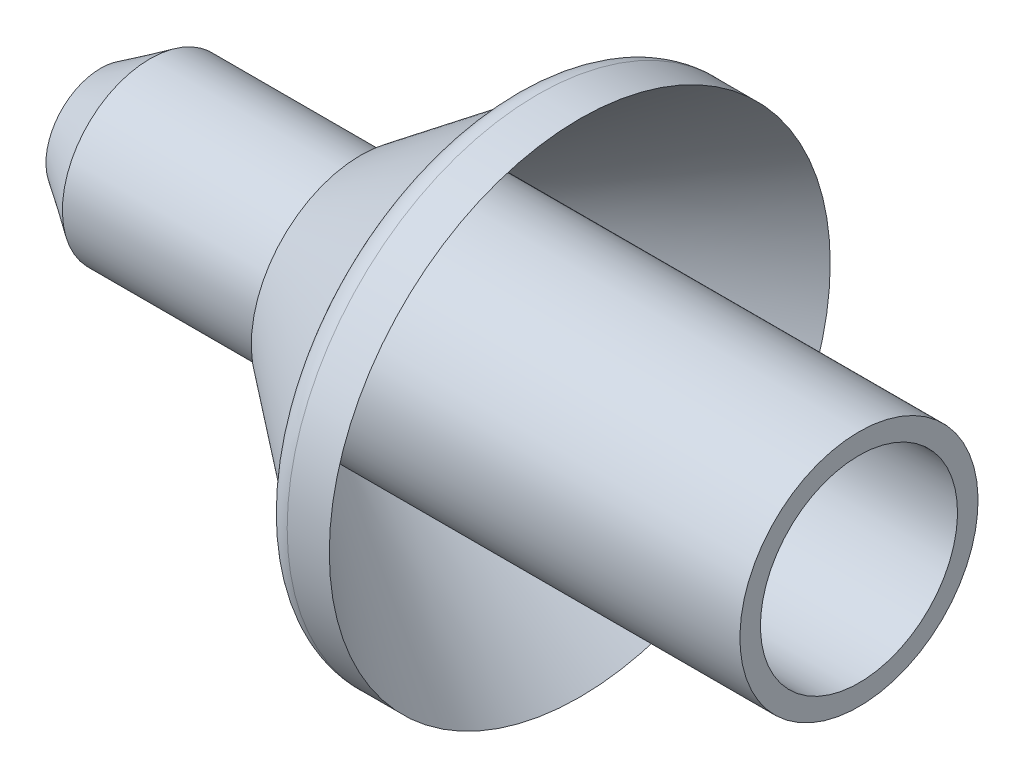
ISO-10303-21;
HEADER;
FILE_DESCRIPTION(('STEP AP214'),'2;1');
FILE_NAME('part.step','',(''),(''),'','','');
FILE_SCHEMA(('AUTOMOTIVE_DESIGN { 1 0 10303 214 1 1 1 1 }'));
ENDSEC;
DATA;
#1=APPLICATION_CONTEXT('core data for automotive mechanical design processes');
#2=APPLICATION_PROTOCOL_DEFINITION('international standard','automotive_design',2000,#1);
#3=PRODUCT_CONTEXT('',#1,'mechanical');
#4=PRODUCT('Part','Part','',(#3));
#5=PRODUCT_RELATED_PRODUCT_CATEGORY('part','',(#4));
#6=PRODUCT_DEFINITION_FORMATION('','',#4);
#7=PRODUCT_DEFINITION_CONTEXT('part definition',#1,'design');
#8=PRODUCT_DEFINITION('design','',#6,#7);
#9=PRODUCT_DEFINITION_SHAPE('','',#8);
#10=(LENGTH_UNIT() NAMED_UNIT(*) SI_UNIT(.MILLI.,.METRE.));
#11=(NAMED_UNIT(*) PLANE_ANGLE_UNIT() SI_UNIT($,.RADIAN.));
#12=(NAMED_UNIT(*) SI_UNIT($,.STERADIAN.) SOLID_ANGLE_UNIT());
#13=UNCERTAINTY_MEASURE_WITH_UNIT(LENGTH_MEASURE(1.E-05),#10,'distance_accuracy_value','');
#14=(GEOMETRIC_REPRESENTATION_CONTEXT(3) GLOBAL_UNCERTAINTY_ASSIGNED_CONTEXT((#13)) GLOBAL_UNIT_ASSIGNED_CONTEXT((#10,
#11,#12)) REPRESENTATION_CONTEXT('',''));
#15=CARTESIAN_POINT('',(0.,0.,0.));
#16=DIRECTION('',(0.,0.,1.));
#17=DIRECTION('',(1.,0.,0.));
#18=AXIS2_PLACEMENT_3D('',#15,#16,#17);
#19=CARTESIAN_POINT('',(0.750000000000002,0.949999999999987,0.));
#20=DIRECTION('',(1.,0.,0.));
#21=DIRECTION('',(0.,1.,0.));
#22=AXIS2_PLACEMENT_3D('',#19,#20,#21);
#23=PLANE('',#22);
#24=CARTESIAN_POINT('',(0.749999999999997,0.,0.));
#25=DIRECTION('',(1.,0.,0.));
#26=DIRECTION('',(0.,1.,0.));
#27=AXIS2_PLACEMENT_3D('',#24,#25,#26);
#28=CIRCLE('',#27,0.94999999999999);
#29=CARTESIAN_POINT('',(0.750000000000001,0.949999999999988,0.));
#30=VERTEX_POINT('',#29);
#31=EDGE_CURVE('E10',#30,#30,#28,.T.);
#32=ORIENTED_EDGE('',*,*,#31,.T.);
#33=EDGE_LOOP('',(#32));
#34=FACE_BOUND('',#33,.T.);
#35=ADVANCED_FACE('F346',(#34),#23,.T.);
#36=CARTESIAN_POINT('',(2.25,0.,0.));
#37=DIRECTION('',(1.,0.,0.));
#38=DIRECTION('',(0.,1.,0.));
#39=AXIS2_PLACEMENT_3D('',#36,#37,#38);
#40=DEGENERATE_TOROIDAL_SURFACE('',#39,0.950000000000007,1.5,.T.);
#41=CARTESIAN_POINT('',(2.25,0.,0.));
#42=DIRECTION('',(1.,0.,0.));
#43=DIRECTION('',(0.,1.,0.));
#44=AXIS2_PLACEMENT_3D('',#41,#42,#43);
#45=CIRCLE('',#44,2.45000000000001);
#46=CARTESIAN_POINT('',(2.25000000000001,2.45,0.));
#47=VERTEX_POINT('',#46);
#48=EDGE_CURVE('E352',#47,#47,#45,.T.);
#49=ORIENTED_EDGE('',*,*,#48,.T.);
#50=EDGE_LOOP('',(#49));
#51=FACE_BOUND('',#50,.T.);
#52=ORIENTED_EDGE('',*,*,#31,.F.);
#53=EDGE_LOOP('',(#52));
#54=FACE_BOUND('',#53,.T.);
#55=ADVANCED_FACE('F408',(#51,#54),#40,.F.);
#56=CARTESIAN_POINT('',(0.750000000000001,0.,0.));
#57=DIRECTION('',(1.,0.,0.));
#58=DIRECTION('',(0.,1.,0.));
#59=AXIS2_PLACEMENT_3D('',#56,#57,#58);
#60=CYLINDRICAL_SURFACE('',#59,2.45000000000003);
#61=CARTESIAN_POINT('',(11.4,0.,0.));
#62=DIRECTION('',(1.,0.,0.));
#63=DIRECTION('',(0.,1.,0.));
#64=AXIS2_PLACEMENT_3D('',#61,#62,#63);
#65=CIRCLE('',#64,2.45000000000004);
#66=CARTESIAN_POINT('',(11.4,2.45,0.));
#67=VERTEX_POINT('',#66);
#68=EDGE_CURVE('E356',#67,#67,#65,.T.);
#69=ORIENTED_EDGE('',*,*,#68,.T.);
#70=EDGE_LOOP('',(#69));
#71=FACE_BOUND('',#70,.T.);
#72=ORIENTED_EDGE('',*,*,#48,.F.);
#73=EDGE_LOOP('',(#72));
#74=FACE_BOUND('',#73,.T.);
#75=ADVANCED_FACE('F412',(#71,#74),#60,.F.);
#76=CARTESIAN_POINT('',(11.4,3.6,0.));
#77=DIRECTION('',(1.,0.,0.));
#78=DIRECTION('',(0.,1.,0.));
#79=AXIS2_PLACEMENT_3D('',#76,#77,#78);
#80=PLANE('',#79);
#81=CARTESIAN_POINT('',(11.4,0.,0.));
#82=DIRECTION('',(1.,0.,0.));
#83=DIRECTION('',(0.,1.,0.));
#84=AXIS2_PLACEMENT_3D('',#81,#82,#83);
#85=CIRCLE('',#84,3.60000000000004);
#86=CARTESIAN_POINT('',(11.4,3.6,0.));
#87=VERTEX_POINT('',#86);
#88=EDGE_CURVE('E360',#87,#87,#85,.T.);
#89=ORIENTED_EDGE('',*,*,#88,.T.);
#90=EDGE_LOOP('',(#89));
#91=FACE_BOUND('',#90,.T.);
#92=ORIENTED_EDGE('',*,*,#68,.F.);
#93=EDGE_LOOP('',(#92));
#94=FACE_BOUND('',#93,.T.);
#95=ADVANCED_FACE('F416',(#91,#94),#80,.T.);
#96=CARTESIAN_POINT('',(0.750000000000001,0.,0.));
#97=DIRECTION('',(1.,0.,0.));
#98=DIRECTION('',(0.,1.,0.));
#99=AXIS2_PLACEMENT_3D('',#96,#97,#98);
#100=CYLINDRICAL_SURFACE('',#99,3.60000000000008);
#101=CARTESIAN_POINT('',(27.7,-1.02419415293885E-13,0.));
#102=DIRECTION('',(1.,0.,0.));
#103=DIRECTION('',(0.,1.,0.));
#104=AXIS2_PLACEMENT_3D('',#101,#102,#103);
#105=CIRCLE('',#104,3.60000000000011);
#106=CARTESIAN_POINT('',(27.7,3.6,0.));
#107=VERTEX_POINT('',#106);
#108=EDGE_CURVE('E365',#107,#107,#105,.T.);
#109=ORIENTED_EDGE('',*,*,#108,.T.);
#110=EDGE_LOOP('',(#109));
#111=FACE_BOUND('',#110,.T.);
#112=ORIENTED_EDGE('',*,*,#88,.F.);
#113=EDGE_LOOP('',(#112));
#114=FACE_BOUND('',#113,.T.);
#115=ADVANCED_FACE('F423',(#111,#114),#100,.F.);
#116=CARTESIAN_POINT('',(27.7,4.35,0.));
#117=DIRECTION('',(1.,0.,0.));
#118=DIRECTION('',(0.,1.,0.));
#119=AXIS2_PLACEMENT_3D('',#116,#117,#118);
#120=PLANE('',#119);
#121=CARTESIAN_POINT('',(27.7,-1.02419415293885E-13,0.));
#122=DIRECTION('',(1.,0.,0.));
#123=DIRECTION('',(0.,1.,0.));
#124=AXIS2_PLACEMENT_3D('',#121,#122,#123);
#125=CIRCLE('',#124,4.3500000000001);
#126=CARTESIAN_POINT('',(27.7,4.35,0.));
#127=VERTEX_POINT('',#126);
#128=EDGE_CURVE('E368',#127,#127,#125,.T.);
#129=ORIENTED_EDGE('',*,*,#128,.T.);
#130=EDGE_LOOP('',(#129));
#131=FACE_BOUND('',#130,.T.);
#132=ORIENTED_EDGE('',*,*,#108,.F.);
#133=EDGE_LOOP('',(#132));
#134=FACE_BOUND('',#133,.T.);
#135=ADVANCED_FACE('F427',(#131,#134),#120,.T.);
#136=CARTESIAN_POINT('',(0.750000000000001,0.,0.));
#137=DIRECTION('',(1.,0.,0.));
#138=DIRECTION('',(0.,1.,0.));
#139=AXIS2_PLACEMENT_3D('',#136,#137,#138);
#140=CYLINDRICAL_SURFACE('',#139,4.35000000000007);
#141=CARTESIAN_POINT('',(11.1974194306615,0.,0.));
#142=DIRECTION('',(1.,0.,0.));
#143=DIRECTION('',(0.,1.,0.));
#144=AXIS2_PLACEMENT_3D('',#141,#142,#143);
#145=CIRCLE('',#144,4.35000000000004);
#146=CARTESIAN_POINT('',(11.1974194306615,4.35,0.));
#147=VERTEX_POINT('',#146);
#148=EDGE_CURVE('E371',#147,#147,#145,.T.);
#149=ORIENTED_EDGE('',*,*,#148,.T.);
#150=EDGE_LOOP('',(#149));
#151=FACE_BOUND('',#150,.T.);
#152=ORIENTED_EDGE('',*,*,#128,.F.);
#153=EDGE_LOOP('',(#152));
#154=FACE_BOUND('',#153,.T.);
#155=ADVANCED_FACE('F431',(#151,#154),#140,.T.);
#156=CARTESIAN_POINT('',(11.1974194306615,0.,0.));
#157=DIRECTION('',(1.,0.,0.));
#158=DIRECTION('',(0.,1.,0.));
#159=AXIS2_PLACEMENT_3D('',#156,#157,#158);
#160=CONICAL_SURFACE('',#159,4.35000000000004,0.650879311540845);
#161=CARTESIAN_POINT('',(17.5,0.,0.));
#162=DIRECTION('',(1.,0.,0.));
#163=DIRECTION('',(0.,1.,0.));
#164=AXIS2_PLACEMENT_3D('',#161,#162,#163);
#165=CIRCLE('',#164,9.15000000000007);
#166=CARTESIAN_POINT('',(17.5,9.15000000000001,0.));
#167=VERTEX_POINT('',#166);
#168=EDGE_CURVE('E374',#167,#167,#165,.T.);
#169=ORIENTED_EDGE('',*,*,#168,.T.);
#170=EDGE_LOOP('',(#169));
#171=FACE_BOUND('',#170,.T.);
#172=ORIENTED_EDGE('',*,*,#148,.F.);
#173=EDGE_LOOP('',(#172));
#174=FACE_BOUND('',#173,.T.);
#175=ADVANCED_FACE('F435',(#171,#174),#160,.F.);
#176=CARTESIAN_POINT('',(0.750000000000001,0.,0.));
#177=DIRECTION('',(1.,0.,0.));
#178=DIRECTION('',(0.,1.,0.));
#179=AXIS2_PLACEMENT_3D('',#176,#177,#178);
#180=CYLINDRICAL_SURFACE('',#179,9.15000000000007);
#181=CARTESIAN_POINT('',(15.9609999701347,0.,0.));
#182=DIRECTION('',(1.,0.,0.));
#183=DIRECTION('',(0.,1.,0.));
#184=AXIS2_PLACEMENT_3D('',#181,#182,#183);
#185=CIRCLE('',#184,9.15000000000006);
#186=CARTESIAN_POINT('',(15.9609999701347,9.15,0.));
#187=VERTEX_POINT('',#186);
#188=EDGE_CURVE('E377',#187,#187,#185,.T.);
#189=ORIENTED_EDGE('',*,*,#188,.T.);
#190=EDGE_LOOP('',(#189));
#191=FACE_BOUND('',#190,.T.);
#192=ORIENTED_EDGE('',*,*,#168,.F.);
#193=EDGE_LOOP('',(#192));
#194=FACE_BOUND('',#193,.T.);
#195=ADVANCED_FACE('F439',(#191,#194),#180,.T.);
#196=CARTESIAN_POINT('',(15.9609999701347,0.,0.));
#197=DIRECTION('',(1.,0.,0.));
#198=DIRECTION('',(0.,1.,0.));
#199=AXIS2_PLACEMENT_3D('',#196,#197,#198);
#200=TOROIDAL_SURFACE('',#199,8.18900000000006,0.960999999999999);
#201=CARTESIAN_POINT('',(15.,0.,0.));
#202=DIRECTION('',(1.,0.,0.));
#203=DIRECTION('',(0.,1.,0.));
#204=AXIS2_PLACEMENT_3D('',#201,#202,#203);
#205=CIRCLE('',#204,8.18876041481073);
#206=CARTESIAN_POINT('',(15.,8.18876041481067,0.));
#207=VERTEX_POINT('',#206);
#208=EDGE_CURVE('E380',#207,#207,#205,.T.);
#209=ORIENTED_EDGE('',*,*,#208,.T.);
#210=EDGE_LOOP('',(#209));
#211=FACE_BOUND('',#210,.T.);
#212=ORIENTED_EDGE('',*,*,#188,.F.);
#213=EDGE_LOOP('',(#212));
#214=FACE_BOUND('',#213,.T.);
#215=ADVANCED_FACE('F443',(#211,#214),#200,.T.);
#216=CARTESIAN_POINT('',(15.,0.,0.));
#217=DIRECTION('',(1.,0.,0.));
#218=DIRECTION('',(0.,1.,0.));
#219=AXIS2_PLACEMENT_3D('',#216,#217,#218);
#220=CONICAL_SURFACE('',#219,8.18876041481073,0.650879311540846);
#221=CARTESIAN_POINT('',(9.49999999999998,0.,0.));
#222=DIRECTION('',(1.,0.,0.));
#223=DIRECTION('',(0.,1.,0.));
#224=AXIS2_PLACEMENT_3D('',#221,#222,#223);
#225=CIRCLE('',#224,4.00000000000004);
#226=CARTESIAN_POINT('',(9.5,4.,0.));
#227=VERTEX_POINT('',#226);
#228=EDGE_CURVE('E383',#227,#227,#225,.T.);
#229=ORIENTED_EDGE('',*,*,#228,.T.);
#230=EDGE_LOOP('',(#229));
#231=FACE_BOUND('',#230,.T.);
#232=ORIENTED_EDGE('',*,*,#208,.F.);
#233=EDGE_LOOP('',(#232));
#234=FACE_BOUND('',#233,.T.);
#235=ADVANCED_FACE('F447',(#231,#234),#220,.T.);
#236=CARTESIAN_POINT('',(9.5,3.2,0.));
#237=DIRECTION('',(-1.,0.,0.));
#238=DIRECTION('',(0.,-1.,0.));
#239=AXIS2_PLACEMENT_3D('',#236,#237,#238);
#240=PLANE('',#239);
#241=CARTESIAN_POINT('',(9.49999999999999,0.,0.));
#242=DIRECTION('',(1.,0.,0.));
#243=DIRECTION('',(0.,1.,0.));
#244=AXIS2_PLACEMENT_3D('',#241,#242,#243);
#245=CIRCLE('',#244,3.20000000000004);
#246=CARTESIAN_POINT('',(9.5,3.2,0.));
#247=VERTEX_POINT('',#246);
#248=EDGE_CURVE('E386',#247,#247,#245,.T.);
#249=ORIENTED_EDGE('',*,*,#248,.T.);
#250=EDGE_LOOP('',(#249));
#251=FACE_BOUND('',#250,.T.);
#252=ORIENTED_EDGE('',*,*,#228,.F.);
#253=EDGE_LOOP('',(#252));
#254=FACE_BOUND('',#253,.T.);
#255=ADVANCED_FACE('F451',(#251,#254),#240,.T.);
#256=CARTESIAN_POINT('',(0.750000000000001,0.,0.));
#257=DIRECTION('',(1.,0.,0.));
#258=DIRECTION('',(0.,1.,0.));
#259=AXIS2_PLACEMENT_3D('',#256,#257,#258);
#260=CYLINDRICAL_SURFACE('',#259,3.20000000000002);
#261=CARTESIAN_POINT('',(1.79999999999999,0.,0.));
#262=DIRECTION('',(1.,0.,0.));
#263=DIRECTION('',(0.,1.,0.));
#264=AXIS2_PLACEMENT_3D('',#261,#262,#263);
#265=CIRCLE('',#264,3.20000000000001);
#266=CARTESIAN_POINT('',(1.8,3.2,0.));
#267=VERTEX_POINT('',#266);
#268=EDGE_CURVE('E389',#267,#267,#265,.T.);
#269=ORIENTED_EDGE('',*,*,#268,.T.);
#270=EDGE_LOOP('',(#269));
#271=FACE_BOUND('',#270,.T.);
#272=ORIENTED_EDGE('',*,*,#248,.F.);
#273=EDGE_LOOP('',(#272));
#274=FACE_BOUND('',#273,.T.);
#275=ADVANCED_FACE('F405',(#271,#274),#260,.T.);
#276=CARTESIAN_POINT('',(1.79999999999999,0.,0.));
#277=DIRECTION('',(1.,0.,0.));
#278=DIRECTION('',(0.,1.,0.));
#279=AXIS2_PLACEMENT_3D('',#276,#277,#278);
#280=CONICAL_SURFACE('',#279,3.20000000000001,0.588002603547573);
#281=CARTESIAN_POINT('',(0.,0.,0.));
#282=DIRECTION('',(1.,0.,0.));
#283=DIRECTION('',(0.,1.,0.));
#284=AXIS2_PLACEMENT_3D('',#281,#282,#283);
#285=CIRCLE('',#284,2.);
#286=CARTESIAN_POINT('',(0.,2.,0.));
#287=VERTEX_POINT('',#286);
#288=EDGE_CURVE('E392',#287,#287,#285,.T.);
#289=ORIENTED_EDGE('',*,*,#288,.T.);
#290=EDGE_LOOP('',(#289));
#291=FACE_BOUND('',#290,.T.);
#292=ORIENTED_EDGE('',*,*,#268,.F.);
#293=EDGE_LOOP('',(#292));
#294=FACE_BOUND('',#293,.T.);
#295=ADVANCED_FACE('F396',(#291,#294),#280,.T.);
#296=CARTESIAN_POINT('',(0.,0.,0.));
#297=DIRECTION('',(-1.,0.,0.));
#298=DIRECTION('',(0.,-1.,0.));
#299=AXIS2_PLACEMENT_3D('',#296,#297,#298);
#300=PLANE('',#299);
#301=ORIENTED_EDGE('',*,*,#288,.F.);
#302=EDGE_LOOP('',(#301));
#303=FACE_BOUND('',#302,.T.);
#304=ADVANCED_FACE('F399',(#303),#300,.T.);
#305=CLOSED_SHELL('',(#35,#55,#75,#95,#115,#135,#155,#175,#195,#215,#235,#255,#275,#295,#304));
#306=MANIFOLD_SOLID_BREP('B2',#305);
#307=ADVANCED_BREP_SHAPE_REPRESENTATION('',(#18,#306),#14);
#308=SHAPE_DEFINITION_REPRESENTATION(#9,#307);
ENDSEC;
END-ISO-10303-21;
